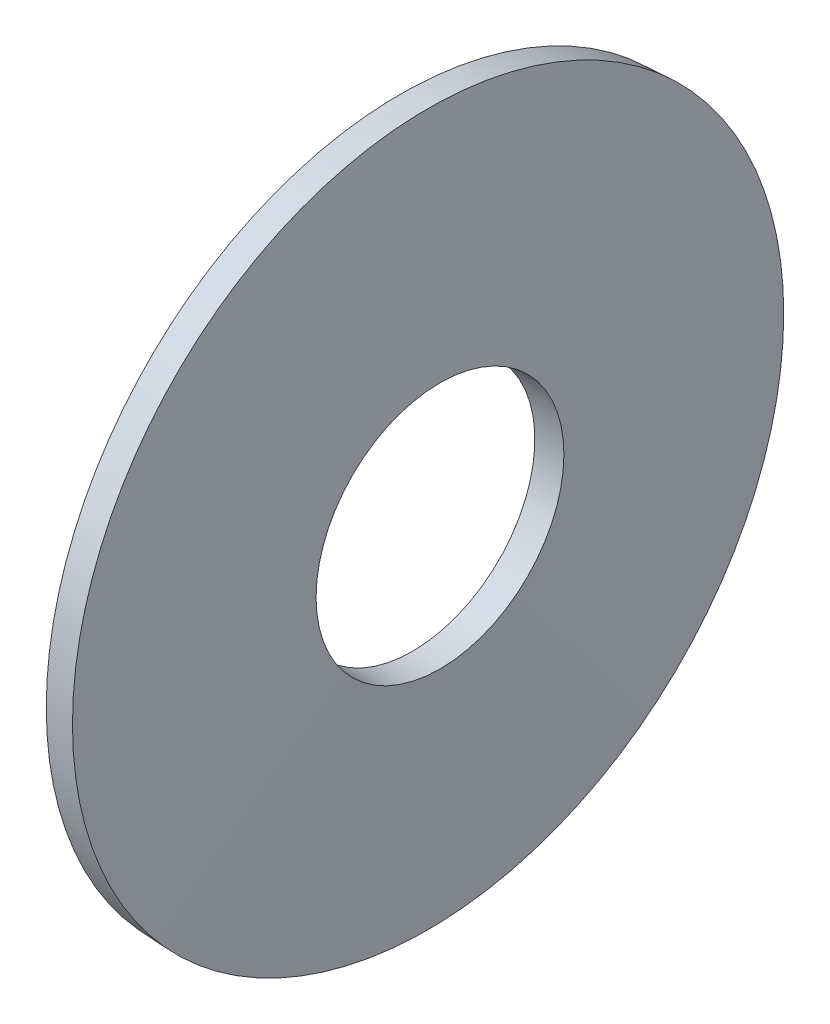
from build123d import *


with BuildPart() as part:
    # Esquisse2 → Base-R_volution (revolve)
    with BuildSketch(Plane.XY, mode=Mode.PRIVATE) as base_r_volution_sk:
        Polygon((0, 8.964126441), (0.300919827, 3.1), (1, 3.135873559), (0.699080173, 9), align=None)
    revolve(base_r_volution_sk.sketch.rotate(Axis((0, 0, 0), (1, 0, 0)), 90), axis=Axis((0, 0, 0), (1, 0, 0)))


solid = part.part
